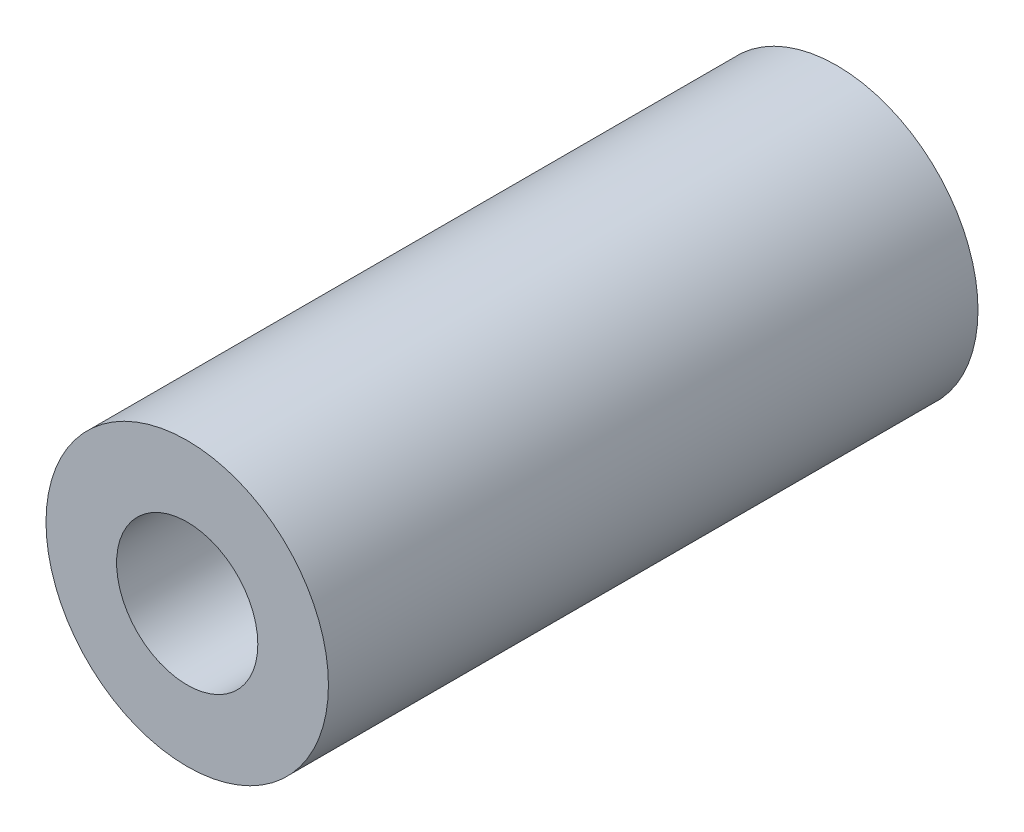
ISO-10303-21;
HEADER;
FILE_DESCRIPTION(('STEP AP214'),'2;1');
FILE_NAME('part.step','',(''),(''),'','','');
FILE_SCHEMA(('AUTOMOTIVE_DESIGN { 1 0 10303 214 1 1 1 1 }'));
ENDSEC;
DATA;
#1=APPLICATION_CONTEXT('core data for automotive mechanical design processes');
#2=APPLICATION_PROTOCOL_DEFINITION('international standard','automotive_design',2000,#1);
#3=PRODUCT_CONTEXT('',#1,'mechanical');
#4=PRODUCT('Part','Part','',(#3));
#5=PRODUCT_RELATED_PRODUCT_CATEGORY('part','',(#4));
#6=PRODUCT_DEFINITION_FORMATION('','',#4);
#7=PRODUCT_DEFINITION_CONTEXT('part definition',#1,'design');
#8=PRODUCT_DEFINITION('design','',#6,#7);
#9=PRODUCT_DEFINITION_SHAPE('','',#8);
#10=(LENGTH_UNIT() NAMED_UNIT(*) SI_UNIT(.MILLI.,.METRE.));
#11=(NAMED_UNIT(*) PLANE_ANGLE_UNIT() SI_UNIT($,.RADIAN.));
#12=(NAMED_UNIT(*) SI_UNIT($,.STERADIAN.) SOLID_ANGLE_UNIT());
#13=UNCERTAINTY_MEASURE_WITH_UNIT(LENGTH_MEASURE(1.E-05),#10,'distance_accuracy_value','');
#14=(GEOMETRIC_REPRESENTATION_CONTEXT(3) GLOBAL_UNCERTAINTY_ASSIGNED_CONTEXT((#13)) GLOBAL_UNIT_ASSIGNED_CONTEXT((#10,
#11,#12)) REPRESENTATION_CONTEXT('',''));
#15=CARTESIAN_POINT('',(0.,0.,0.));
#16=DIRECTION('',(0.,0.,1.));
#17=DIRECTION('',(1.,0.,0.));
#18=AXIS2_PLACEMENT_3D('',#15,#16,#17);
#19=CARTESIAN_POINT('',(0.,0.,115.));
#20=DIRECTION('',(0.,0.,1.));
#21=DIRECTION('',(1.,0.,0.));
#22=AXIS2_PLACEMENT_3D('',#19,#20,#21);
#23=PLANE('',#22);
#24=CARTESIAN_POINT('',(0.,0.,115.));
#25=DIRECTION('',(0.,0.,1.));
#26=DIRECTION('',(1.,0.,0.));
#27=AXIS2_PLACEMENT_3D('',#24,#25,#26);
#28=CIRCLE('',#27,25.);
#29=CARTESIAN_POINT('',(25.,0.,115.));
#30=VERTEX_POINT('',#29);
#31=EDGE_CURVE('E9',#30,#30,#28,.T.);
#32=ORIENTED_EDGE('',*,*,#31,.T.);
#33=EDGE_LOOP('',(#32));
#34=FACE_BOUND('',#33,.T.);
#35=CARTESIAN_POINT('',(0.,0.,115.));
#36=DIRECTION('',(0.,0.,1.));
#37=DIRECTION('',(1.,0.,0.));
#38=AXIS2_PLACEMENT_3D('',#35,#36,#37);
#39=CIRCLE('',#38,12.5);
#40=CARTESIAN_POINT('',(12.5,0.,115.));
#41=VERTEX_POINT('',#40);
#42=EDGE_CURVE('E25',#41,#41,#39,.T.);
#43=ORIENTED_EDGE('',*,*,#42,.F.);
#44=EDGE_LOOP('',(#43));
#45=FACE_BOUND('',#44,.T.);
#46=ADVANCED_FACE('F14',(#34,#45),#23,.T.);
#47=CARTESIAN_POINT('',(0.,0.,0.));
#48=DIRECTION('',(0.,0.,1.));
#49=DIRECTION('',(1.,0.,0.));
#50=AXIS2_PLACEMENT_3D('',#47,#48,#49);
#51=PLANE('',#50);
#52=CARTESIAN_POINT('',(0.,0.,0.));
#53=DIRECTION('',(0.,0.,1.));
#54=DIRECTION('',(1.,0.,0.));
#55=AXIS2_PLACEMENT_3D('',#52,#53,#54);
#56=CIRCLE('',#55,25.);
#57=CARTESIAN_POINT('',(25.,0.,0.));
#58=VERTEX_POINT('',#57);
#59=EDGE_CURVE('E18',#58,#58,#56,.T.);
#60=ORIENTED_EDGE('',*,*,#59,.F.);
#61=EDGE_LOOP('',(#60));
#62=FACE_BOUND('',#61,.T.);
#63=CARTESIAN_POINT('',(0.,0.,0.));
#64=DIRECTION('',(0.,0.,1.));
#65=DIRECTION('',(1.,0.,0.));
#66=AXIS2_PLACEMENT_3D('',#63,#64,#65);
#67=CIRCLE('',#66,12.5);
#68=CARTESIAN_POINT('',(12.5,0.,0.));
#69=VERTEX_POINT('',#68);
#70=EDGE_CURVE('E27',#69,#69,#67,.T.);
#71=ORIENTED_EDGE('',*,*,#70,.T.);
#72=EDGE_LOOP('',(#71));
#73=FACE_BOUND('',#72,.T.);
#74=ADVANCED_FACE('F37',(#62,#73),#51,.F.);
#75=CARTESIAN_POINT('',(0.,0.,115.));
#76=DIRECTION('',(0.,0.,-1.));
#77=DIRECTION('',(-1.,0.,0.));
#78=AXIS2_PLACEMENT_3D('',#75,#76,#77);
#79=CYLINDRICAL_SURFACE('',#78,25.);
#80=ORIENTED_EDGE('',*,*,#31,.F.);
#81=EDGE_LOOP('',(#80));
#82=FACE_BOUND('',#81,.T.);
#83=ORIENTED_EDGE('',*,*,#59,.T.);
#84=EDGE_LOOP('',(#83));
#85=FACE_BOUND('',#84,.T.);
#86=ADVANCED_FACE('F16',(#82,#85),#79,.T.);
#87=CARTESIAN_POINT('',(0.,0.,115.));
#88=DIRECTION('',(0.,0.,-1.));
#89=DIRECTION('',(-1.,0.,0.));
#90=AXIS2_PLACEMENT_3D('',#87,#88,#89);
#91=CYLINDRICAL_SURFACE('',#90,12.5);
#92=ORIENTED_EDGE('',*,*,#42,.T.);
#93=EDGE_LOOP('',(#92));
#94=FACE_BOUND('',#93,.T.);
#95=ORIENTED_EDGE('',*,*,#70,.F.);
#96=EDGE_LOOP('',(#95));
#97=FACE_BOUND('',#96,.T.);
#98=ADVANCED_FACE('F33',(#94,#97),#91,.F.);
#99=CLOSED_SHELL('',(#46,#74,#86,#98));
#100=MANIFOLD_SOLID_BREP('B1',#99);
#101=ADVANCED_BREP_SHAPE_REPRESENTATION('',(#18,#100),#14);
#102=SHAPE_DEFINITION_REPRESENTATION(#9,#101);
ENDSEC;
END-ISO-10303-21;
